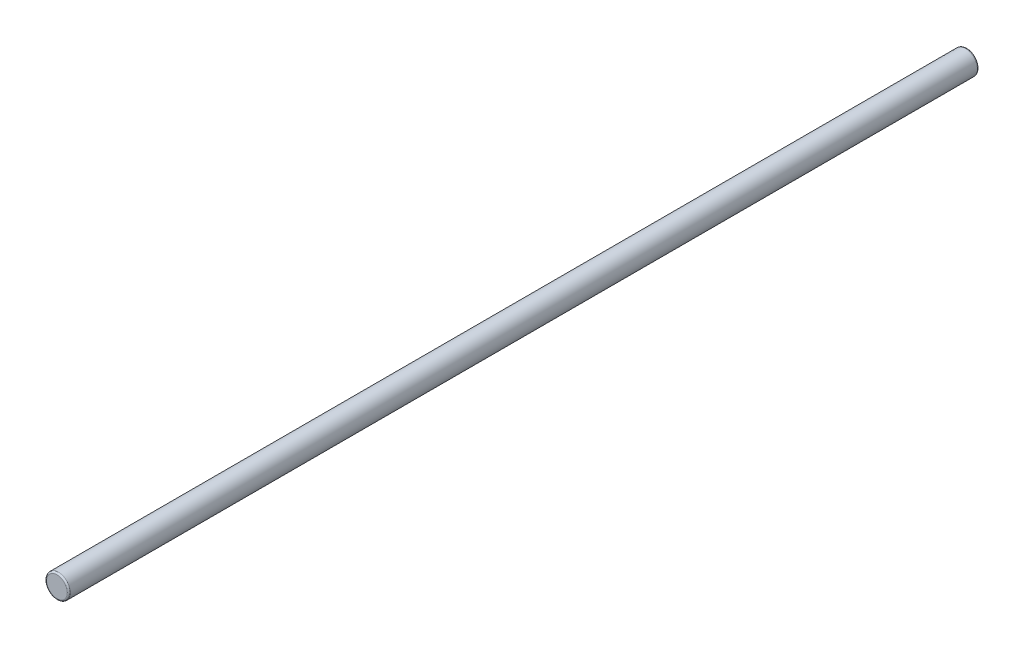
from build123d import *

# Parameters (mm, degrees)
SKETCH1_R      = 3.96875
EXTRUDE1_DEPTH = 304.8
FILLET1_R      = 0.508


with BuildPart() as part:
    # Sketch1 → Extrude1 (new body)
    with BuildSketch(Plane.XY):
        Circle(SKETCH1_R)
    extrude(amount=-EXTRUDE1_DEPTH)

    # Fillet1
    fillet1_edges = [part.edges().sort_by_distance(p)[0] for p in [
        (-3.96875, 0, 0),
        (-3.96875, 0, -304.8),
    ]]
    fillet(fillet1_edges, radius=FILLET1_R)


solid = part.part
